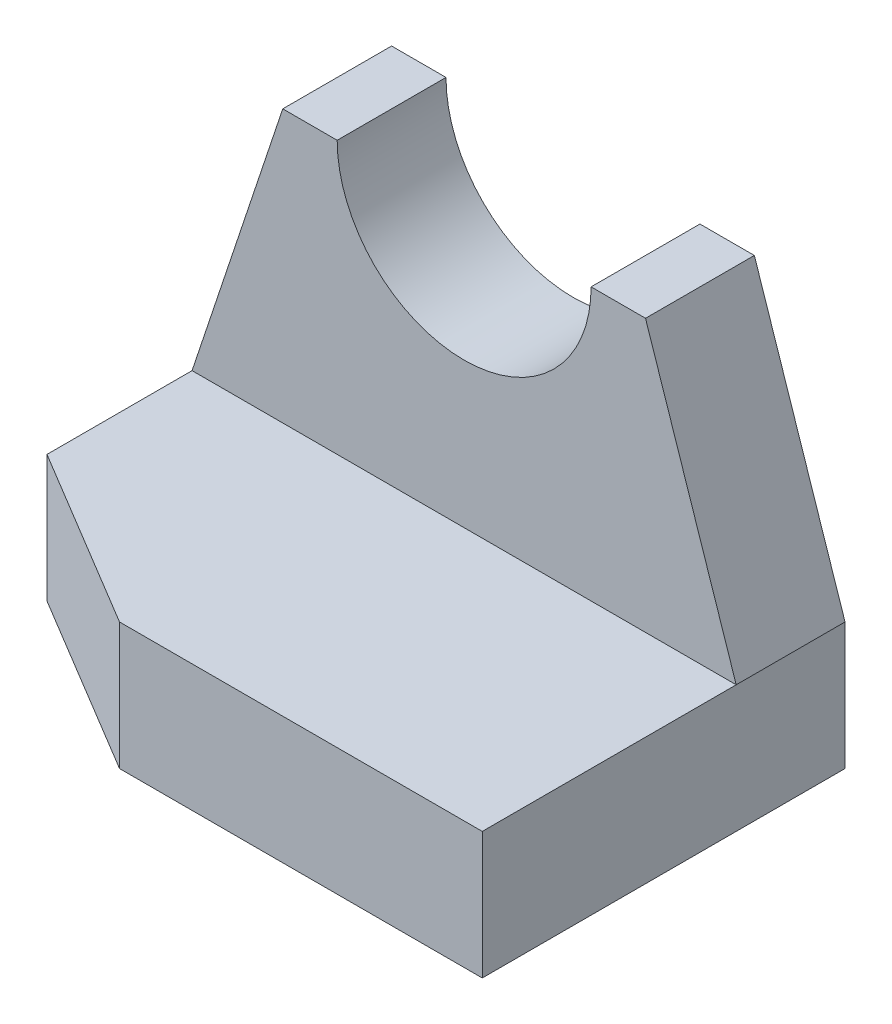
ISO-10303-21;
HEADER;
FILE_DESCRIPTION(('STEP AP214'),'2;1');
FILE_NAME('part.step','',(''),(''),'','','');
FILE_SCHEMA(('AUTOMOTIVE_DESIGN { 1 0 10303 214 1 1 1 1 }'));
ENDSEC;
DATA;
#1=APPLICATION_CONTEXT('core data for automotive mechanical design processes');
#2=APPLICATION_PROTOCOL_DEFINITION('international standard','automotive_design',2000,#1);
#3=PRODUCT_CONTEXT('',#1,'mechanical');
#4=PRODUCT('Part','Part','',(#3));
#5=PRODUCT_RELATED_PRODUCT_CATEGORY('part','',(#4));
#6=PRODUCT_DEFINITION_FORMATION('','',#4);
#7=PRODUCT_DEFINITION_CONTEXT('part definition',#1,'design');
#8=PRODUCT_DEFINITION('design','',#6,#7);
#9=PRODUCT_DEFINITION_SHAPE('','',#8);
#10=(LENGTH_UNIT() NAMED_UNIT(*) SI_UNIT(.MILLI.,.METRE.));
#11=(NAMED_UNIT(*) PLANE_ANGLE_UNIT() SI_UNIT($,.RADIAN.));
#12=(NAMED_UNIT(*) SI_UNIT($,.STERADIAN.) SOLID_ANGLE_UNIT());
#13=UNCERTAINTY_MEASURE_WITH_UNIT(LENGTH_MEASURE(1.E-05),#10,'distance_accuracy_value','');
#14=(GEOMETRIC_REPRESENTATION_CONTEXT(3) GLOBAL_UNCERTAINTY_ASSIGNED_CONTEXT((#13)) GLOBAL_UNIT_ASSIGNED_CONTEXT((#10,
#11,#12)) REPRESENTATION_CONTEXT('',''));
#15=CARTESIAN_POINT('',(0.,0.,0.));
#16=DIRECTION('',(0.,0.,1.));
#17=DIRECTION('',(1.,0.,0.));
#18=AXIS2_PLACEMENT_3D('',#15,#16,#17);
#19=CARTESIAN_POINT('',(-15.,7.,0.));
#20=DIRECTION('',(0.,1.,0.));
#21=DIRECTION('',(0.,0.,1.));
#22=AXIS2_PLACEMENT_3D('',#19,#20,#21);
#23=PLANE('',#22);
#24=DIRECTION('',(0.,0.,-1.));
#25=VECTOR('',#24,1.);
#26=CARTESIAN_POINT('',(15.,7.,0.));
#27=LINE('',#26,#25);
#28=CARTESIAN_POINT('',(15.,7.,20.));
#29=VERTEX_POINT('',#28);
#30=CARTESIAN_POINT('',(15.,7.,6.));
#31=VERTEX_POINT('',#30);
#32=EDGE_CURVE('E158',#29,#31,#27,.T.);
#33=ORIENTED_EDGE('',*,*,#32,.T.);
#34=DIRECTION('',(-1.,0.,0.));
#35=VECTOR('',#34,1.);
#36=CARTESIAN_POINT('',(-15.,7.,6.));
#37=LINE('',#36,#35);
#38=CARTESIAN_POINT('',(-15.,7.,6.));
#39=VERTEX_POINT('',#38);
#40=EDGE_CURVE('E155',#31,#39,#37,.T.);
#41=ORIENTED_EDGE('',*,*,#40,.T.);
#42=DIRECTION('',(0.,0.,1.));
#43=VECTOR('',#42,1.);
#44=CARTESIAN_POINT('',(-15.,7.,0.));
#45=LINE('',#44,#43);
#46=CARTESIAN_POINT('',(-15.,7.,14.));
#47=VERTEX_POINT('',#46);
#48=EDGE_CURVE('E86',#39,#47,#45,.T.);
#49=ORIENTED_EDGE('',*,*,#48,.T.);
#50=DIRECTION('',(0.857492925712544,0.,0.514495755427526));
#51=VECTOR('',#50,1.);
#52=CARTESIAN_POINT('',(-15.,7.,14.));
#53=LINE('',#52,#51);
#54=CARTESIAN_POINT('',(-5.,7.,20.));
#55=VERTEX_POINT('',#54);
#56=EDGE_CURVE('E181',#47,#55,#53,.T.);
#57=ORIENTED_EDGE('',*,*,#56,.T.);
#58=DIRECTION('',(1.,0.,0.));
#59=VECTOR('',#58,1.);
#60=CARTESIAN_POINT('',(-5.,7.,20.));
#61=LINE('',#60,#59);
#62=EDGE_CURVE('E57',#55,#29,#61,.T.);
#63=ORIENTED_EDGE('',*,*,#62,.T.);
#64=EDGE_LOOP('',(#33,#41,#49,#57,#63));
#65=FACE_BOUND('',#64,.T.);
#66=ADVANCED_FACE('F31',(#65),#23,.T.);
#67=CARTESIAN_POINT('',(-15.,7.,0.));
#68=DIRECTION('',(1.,0.,0.));
#69=DIRECTION('',(0.,0.,-1.));
#70=AXIS2_PLACEMENT_3D('',#67,#68,#69);
#71=PLANE('',#70);
#72=DIRECTION('',(0.,0.,1.));
#73=VECTOR('',#72,1.);
#74=CARTESIAN_POINT('',(-15.,0.,0.));
#75=LINE('',#74,#73);
#76=CARTESIAN_POINT('',(-15.,0.,0.));
#77=VERTEX_POINT('',#76);
#78=CARTESIAN_POINT('',(-15.,0.,14.));
#79=VERTEX_POINT('',#78);
#80=EDGE_CURVE('E188',#77,#79,#75,.T.);
#81=ORIENTED_EDGE('',*,*,#80,.T.);
#82=DIRECTION('',(0.,-1.,0.));
#83=VECTOR('',#82,1.);
#84=CARTESIAN_POINT('',(-15.,7.,14.));
#85=LINE('',#84,#83);
#86=EDGE_CURVE('E11',#47,#79,#85,.T.);
#87=ORIENTED_EDGE('',*,*,#86,.F.);
#88=ORIENTED_EDGE('',*,*,#48,.F.);
#89=CARTESIAN_POINT('',(-15.,7.,0.));
#90=VERTEX_POINT('',#89);
#91=EDGE_CURVE('E183',#90,#39,#45,.T.);
#92=ORIENTED_EDGE('',*,*,#91,.F.);
#93=DIRECTION('',(0.,-1.,0.));
#94=VECTOR('',#93,1.);
#95=CARTESIAN_POINT('',(-15.,7.,0.));
#96=LINE('',#95,#94);
#97=EDGE_CURVE('E179',#90,#77,#96,.T.);
#98=ORIENTED_EDGE('',*,*,#97,.T.);
#99=EDGE_LOOP('',(#81,#87,#88,#92,#98));
#100=FACE_BOUND('',#99,.T.);
#101=ADVANCED_FACE('F33',(#100),#71,.F.);
#102=CARTESIAN_POINT('',(-15.,7.,14.));
#103=DIRECTION('',(0.514495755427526,0.,-0.857492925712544));
#104=DIRECTION('',(-0.857492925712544,0.,-0.514495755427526));
#105=AXIS2_PLACEMENT_3D('',#102,#103,#104);
#106=PLANE('',#105);
#107=DIRECTION('',(0.857492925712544,0.,0.514495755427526));
#108=VECTOR('',#107,1.);
#109=CARTESIAN_POINT('',(-15.,0.,14.));
#110=LINE('',#109,#108);
#111=CARTESIAN_POINT('',(-5.,0.,20.));
#112=VERTEX_POINT('',#111);
#113=EDGE_CURVE('E191',#79,#112,#110,.T.);
#114=ORIENTED_EDGE('',*,*,#113,.T.);
#115=DIRECTION('',(0.,-1.,0.));
#116=VECTOR('',#115,1.);
#117=CARTESIAN_POINT('',(-5.,7.,20.));
#118=LINE('',#117,#116);
#119=EDGE_CURVE('E40',#55,#112,#118,.T.);
#120=ORIENTED_EDGE('',*,*,#119,.F.);
#121=ORIENTED_EDGE('',*,*,#56,.F.);
#122=ORIENTED_EDGE('',*,*,#86,.T.);
#123=EDGE_LOOP('',(#114,#120,#121,#122));
#124=FACE_BOUND('',#123,.T.);
#125=ADVANCED_FACE('F225',(#124),#106,.F.);
#126=CARTESIAN_POINT('',(-5.,7.,20.));
#127=DIRECTION('',(0.,0.,-1.));
#128=DIRECTION('',(-1.,0.,0.));
#129=AXIS2_PLACEMENT_3D('',#126,#127,#128);
#130=PLANE('',#129);
#131=DIRECTION('',(1.,0.,0.));
#132=VECTOR('',#131,1.);
#133=CARTESIAN_POINT('',(-5.,0.,20.));
#134=LINE('',#133,#132);
#135=CARTESIAN_POINT('',(15.,0.,20.));
#136=VERTEX_POINT('',#135);
#137=EDGE_CURVE('E193',#112,#136,#134,.T.);
#138=ORIENTED_EDGE('',*,*,#137,.T.);
#139=DIRECTION('',(0.,-1.,0.));
#140=VECTOR('',#139,1.);
#141=CARTESIAN_POINT('',(15.,7.,20.));
#142=LINE('',#141,#140);
#143=EDGE_CURVE('E199',#29,#136,#142,.T.);
#144=ORIENTED_EDGE('',*,*,#143,.F.);
#145=ORIENTED_EDGE('',*,*,#62,.F.);
#146=ORIENTED_EDGE('',*,*,#119,.T.);
#147=EDGE_LOOP('',(#138,#144,#145,#146));
#148=FACE_BOUND('',#147,.T.);
#149=ADVANCED_FACE('F229',(#148),#130,.F.);
#150=CARTESIAN_POINT('',(15.,7.,0.));
#151=DIRECTION('',(-1.,0.,0.));
#152=DIRECTION('',(0.,0.,1.));
#153=AXIS2_PLACEMENT_3D('',#150,#151,#152);
#154=PLANE('',#153);
#155=DIRECTION('',(0.,0.,-1.));
#156=VECTOR('',#155,1.);
#157=CARTESIAN_POINT('',(15.,0.,0.));
#158=LINE('',#157,#156);
#159=CARTESIAN_POINT('',(15.,0.,0.));
#160=VERTEX_POINT('',#159);
#161=EDGE_CURVE('E195',#136,#160,#158,.T.);
#162=ORIENTED_EDGE('',*,*,#161,.T.);
#163=DIRECTION('',(0.,-1.,0.));
#164=VECTOR('',#163,1.);
#165=CARTESIAN_POINT('',(15.,7.,0.));
#166=LINE('',#165,#164);
#167=CARTESIAN_POINT('',(15.,7.,0.));
#168=VERTEX_POINT('',#167);
#169=EDGE_CURVE('E178',#168,#160,#166,.T.);
#170=ORIENTED_EDGE('',*,*,#169,.F.);
#171=DIRECTION('',(0.,0.,-1.));
#172=VECTOR('',#171,1.);
#173=CARTESIAN_POINT('',(15.,7.,6.));
#174=LINE('',#173,#172);
#175=EDGE_CURVE('E164',#31,#168,#174,.T.);
#176=ORIENTED_EDGE('',*,*,#175,.F.);
#177=ORIENTED_EDGE('',*,*,#32,.F.);
#178=ORIENTED_EDGE('',*,*,#143,.T.);
#179=EDGE_LOOP('',(#162,#170,#176,#177,#178));
#180=FACE_BOUND('',#179,.T.);
#181=ADVANCED_FACE('F176',(#180),#154,.F.);
#182=CARTESIAN_POINT('',(-15.,7.,0.));
#183=DIRECTION('',(0.,0.,1.));
#184=DIRECTION('',(1.,0.,0.));
#185=AXIS2_PLACEMENT_3D('',#182,#183,#184);
#186=PLANE('',#185);
#187=DIRECTION('',(-1.,0.,0.));
#188=VECTOR('',#187,1.);
#189=CARTESIAN_POINT('',(-15.,0.,0.));
#190=LINE('',#189,#188);
#191=EDGE_CURVE('E81',#160,#77,#190,.T.);
#192=ORIENTED_EDGE('',*,*,#191,.T.);
#193=ORIENTED_EDGE('',*,*,#97,.F.);
#194=DIRECTION('',(0.316227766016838,0.948683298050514,0.));
#195=VECTOR('',#194,1.);
#196=CARTESIAN_POINT('',(-10.,22.,0.));
#197=LINE('',#196,#195);
#198=CARTESIAN_POINT('',(-10.,22.,0.));
#199=VERTEX_POINT('',#198);
#200=EDGE_CURVE('E148',#90,#199,#197,.T.);
#201=ORIENTED_EDGE('',*,*,#200,.T.);
#202=DIRECTION('',(1.,0.,0.));
#203=VECTOR('',#202,1.);
#204=CARTESIAN_POINT('',(-7.,22.,0.));
#205=LINE('',#204,#203);
#206=CARTESIAN_POINT('',(-7.,22.,0.));
#207=VERTEX_POINT('',#206);
#208=EDGE_CURVE('E145',#199,#207,#205,.T.);
#209=ORIENTED_EDGE('',*,*,#208,.T.);
#210=CARTESIAN_POINT('',(0.,22.,0.));
#211=DIRECTION('',(0.,0.,1.));
#212=DIRECTION('',(-1.,0.,0.));
#213=AXIS2_PLACEMENT_3D('',#210,#211,#212);
#214=CIRCLE('',#213,7.);
#215=CARTESIAN_POINT('',(7.,22.,0.));
#216=VERTEX_POINT('',#215);
#217=EDGE_CURVE('E213',#207,#216,#214,.T.);
#218=ORIENTED_EDGE('',*,*,#217,.T.);
#219=DIRECTION('',(1.,0.,0.));
#220=VECTOR('',#219,1.);
#221=CARTESIAN_POINT('',(10.,22.,0.));
#222=LINE('',#221,#220);
#223=CARTESIAN_POINT('',(10.,22.,0.));
#224=VERTEX_POINT('',#223);
#225=EDGE_CURVE('E127',#216,#224,#222,.T.);
#226=ORIENTED_EDGE('',*,*,#225,.T.);
#227=DIRECTION('',(0.316227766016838,-0.948683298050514,0.));
#228=VECTOR('',#227,1.);
#229=CARTESIAN_POINT('',(10.,22.,0.));
#230=LINE('',#229,#228);
#231=EDGE_CURVE('E211',#224,#168,#230,.T.);
#232=ORIENTED_EDGE('',*,*,#231,.T.);
#233=ORIENTED_EDGE('',*,*,#169,.T.);
#234=EDGE_LOOP('',(#192,#193,#201,#209,#218,#226,#232,#233));
#235=FACE_BOUND('',#234,.T.);
#236=ADVANCED_FACE('F214',(#235),#186,.F.);
#237=CARTESIAN_POINT('',(-15.,0.,0.));
#238=DIRECTION('',(0.,1.,0.));
#239=DIRECTION('',(0.,0.,1.));
#240=AXIS2_PLACEMENT_3D('',#237,#238,#239);
#241=PLANE('',#240);
#242=ORIENTED_EDGE('',*,*,#80,.F.);
#243=ORIENTED_EDGE('',*,*,#191,.F.);
#244=ORIENTED_EDGE('',*,*,#161,.F.);
#245=ORIENTED_EDGE('',*,*,#137,.F.);
#246=ORIENTED_EDGE('',*,*,#113,.F.);
#247=EDGE_LOOP('',(#242,#243,#244,#245,#246));
#248=FACE_BOUND('',#247,.T.);
#249=ADVANCED_FACE('F232',(#248),#241,.F.);
#250=CARTESIAN_POINT('',(0.,22.,6.));
#251=DIRECTION('',(0.,0.,-1.));
#252=DIRECTION('',(-1.,0.,0.));
#253=AXIS2_PLACEMENT_3D('',#250,#251,#252);
#254=CYLINDRICAL_SURFACE('',#253,7.);
#255=ORIENTED_EDGE('',*,*,#217,.F.);
#256=DIRECTION('',(0.,0.,-1.));
#257=VECTOR('',#256,1.);
#258=CARTESIAN_POINT('',(-7.,22.,6.));
#259=LINE('',#258,#257);
#260=CARTESIAN_POINT('',(-7.,22.,6.));
#261=VERTEX_POINT('',#260);
#262=EDGE_CURVE('E144',#261,#207,#259,.T.);
#263=ORIENTED_EDGE('',*,*,#262,.F.);
#264=CARTESIAN_POINT('',(0.,22.,6.));
#265=DIRECTION('',(0.,0.,1.));
#266=DIRECTION('',(-1.,0.,0.));
#267=AXIS2_PLACEMENT_3D('',#264,#265,#266);
#268=CIRCLE('',#267,7.);
#269=CARTESIAN_POINT('',(7.,22.,6.));
#270=VERTEX_POINT('',#269);
#271=EDGE_CURVE('E138',#261,#270,#268,.T.);
#272=ORIENTED_EDGE('',*,*,#271,.T.);
#273=DIRECTION('',(0.,0.,-1.));
#274=VECTOR('',#273,1.);
#275=CARTESIAN_POINT('',(7.,22.,6.));
#276=LINE('',#275,#274);
#277=EDGE_CURVE('E122',#270,#216,#276,.T.);
#278=ORIENTED_EDGE('',*,*,#277,.T.);
#279=EDGE_LOOP('',(#255,#263,#272,#278));
#280=FACE_BOUND('',#279,.T.);
#281=ADVANCED_FACE('F143',(#280),#254,.F.);
#282=CARTESIAN_POINT('',(-7.,22.,6.));
#283=DIRECTION('',(0.,1.,0.));
#284=DIRECTION('',(0.,0.,1.));
#285=AXIS2_PLACEMENT_3D('',#282,#283,#284);
#286=PLANE('',#285);
#287=ORIENTED_EDGE('',*,*,#208,.F.);
#288=DIRECTION('',(0.,0.,-1.));
#289=VECTOR('',#288,1.);
#290=CARTESIAN_POINT('',(-10.,22.,6.));
#291=LINE('',#290,#289);
#292=CARTESIAN_POINT('',(-10.,22.,6.));
#293=VERTEX_POINT('',#292);
#294=EDGE_CURVE('E166',#293,#199,#291,.T.);
#295=ORIENTED_EDGE('',*,*,#294,.F.);
#296=DIRECTION('',(1.,0.,0.));
#297=VECTOR('',#296,1.);
#298=CARTESIAN_POINT('',(-7.,22.,6.));
#299=LINE('',#298,#297);
#300=EDGE_CURVE('E133',#293,#261,#299,.T.);
#301=ORIENTED_EDGE('',*,*,#300,.T.);
#302=ORIENTED_EDGE('',*,*,#262,.T.);
#303=EDGE_LOOP('',(#287,#295,#301,#302));
#304=FACE_BOUND('',#303,.T.);
#305=ADVANCED_FACE('F217',(#304),#286,.T.);
#306=CARTESIAN_POINT('',(-10.,22.,6.));
#307=DIRECTION('',(-0.948683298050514,0.316227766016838,0.));
#308=DIRECTION('',(-0.316227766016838,-0.948683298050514,0.));
#309=AXIS2_PLACEMENT_3D('',#306,#307,#308);
#310=PLANE('',#309);
#311=ORIENTED_EDGE('',*,*,#200,.F.);
#312=ORIENTED_EDGE('',*,*,#91,.T.);
#313=DIRECTION('',(0.316227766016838,0.948683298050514,0.));
#314=VECTOR('',#313,1.);
#315=CARTESIAN_POINT('',(-10.,22.,6.));
#316=LINE('',#315,#314);
#317=EDGE_CURVE('E48',#39,#293,#316,.T.);
#318=ORIENTED_EDGE('',*,*,#317,.T.);
#319=ORIENTED_EDGE('',*,*,#294,.T.);
#320=EDGE_LOOP('',(#311,#312,#318,#319));
#321=FACE_BOUND('',#320,.T.);
#322=ADVANCED_FACE('F219',(#321),#310,.T.);
#323=CARTESIAN_POINT('',(10.,22.,6.));
#324=DIRECTION('',(0.948683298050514,0.316227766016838,0.));
#325=DIRECTION('',(-0.316227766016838,0.948683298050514,0.));
#326=AXIS2_PLACEMENT_3D('',#323,#324,#325);
#327=PLANE('',#326);
#328=ORIENTED_EDGE('',*,*,#231,.F.);
#329=DIRECTION('',(0.,0.,-1.));
#330=VECTOR('',#329,1.);
#331=CARTESIAN_POINT('',(10.,22.,6.));
#332=LINE('',#331,#330);
#333=CARTESIAN_POINT('',(10.,22.,6.));
#334=VERTEX_POINT('',#333);
#335=EDGE_CURVE('E132',#334,#224,#332,.T.);
#336=ORIENTED_EDGE('',*,*,#335,.F.);
#337=DIRECTION('',(0.316227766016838,-0.948683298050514,0.));
#338=VECTOR('',#337,1.);
#339=CARTESIAN_POINT('',(10.,22.,6.));
#340=LINE('',#339,#338);
#341=EDGE_CURVE('E141',#334,#31,#340,.T.);
#342=ORIENTED_EDGE('',*,*,#341,.T.);
#343=ORIENTED_EDGE('',*,*,#175,.T.);
#344=EDGE_LOOP('',(#328,#336,#342,#343));
#345=FACE_BOUND('',#344,.T.);
#346=ADVANCED_FACE('F171',(#345),#327,.T.);
#347=CARTESIAN_POINT('',(10.,22.,6.));
#348=DIRECTION('',(0.,1.,0.));
#349=DIRECTION('',(0.,0.,1.));
#350=AXIS2_PLACEMENT_3D('',#347,#348,#349);
#351=PLANE('',#350);
#352=ORIENTED_EDGE('',*,*,#225,.F.);
#353=ORIENTED_EDGE('',*,*,#277,.F.);
#354=DIRECTION('',(1.,0.,0.));
#355=VECTOR('',#354,1.);
#356=CARTESIAN_POINT('',(10.,22.,6.));
#357=LINE('',#356,#355);
#358=EDGE_CURVE('E125',#270,#334,#357,.T.);
#359=ORIENTED_EDGE('',*,*,#358,.T.);
#360=ORIENTED_EDGE('',*,*,#335,.T.);
#361=EDGE_LOOP('',(#352,#353,#359,#360));
#362=FACE_BOUND('',#361,.T.);
#363=ADVANCED_FACE('F124',(#362),#351,.T.);
#364=CARTESIAN_POINT('',(0.,22.,6.));
#365=DIRECTION('',(0.,0.,-1.));
#366=DIRECTION('',(-1.,0.,0.));
#367=AXIS2_PLACEMENT_3D('',#364,#365,#366);
#368=PLANE('',#367);
#369=ORIENTED_EDGE('',*,*,#271,.F.);
#370=ORIENTED_EDGE('',*,*,#300,.F.);
#371=ORIENTED_EDGE('',*,*,#317,.F.);
#372=ORIENTED_EDGE('',*,*,#40,.F.);
#373=ORIENTED_EDGE('',*,*,#341,.F.);
#374=ORIENTED_EDGE('',*,*,#358,.F.);
#375=EDGE_LOOP('',(#369,#370,#371,#372,#373,#374));
#376=FACE_BOUND('',#375,.T.);
#377=ADVANCED_FACE('F137',(#376),#368,.F.);
#378=CLOSED_SHELL('',(#66,#101,#125,#149,#181,#236,#249,#281,#305,#322,#346,#363,#377));
#379=MANIFOLD_SOLID_BREP('B2',#378);
#380=ADVANCED_BREP_SHAPE_REPRESENTATION('',(#18,#379),#14);
#381=SHAPE_DEFINITION_REPRESENTATION(#9,#380);
ENDSEC;
END-ISO-10303-21;
